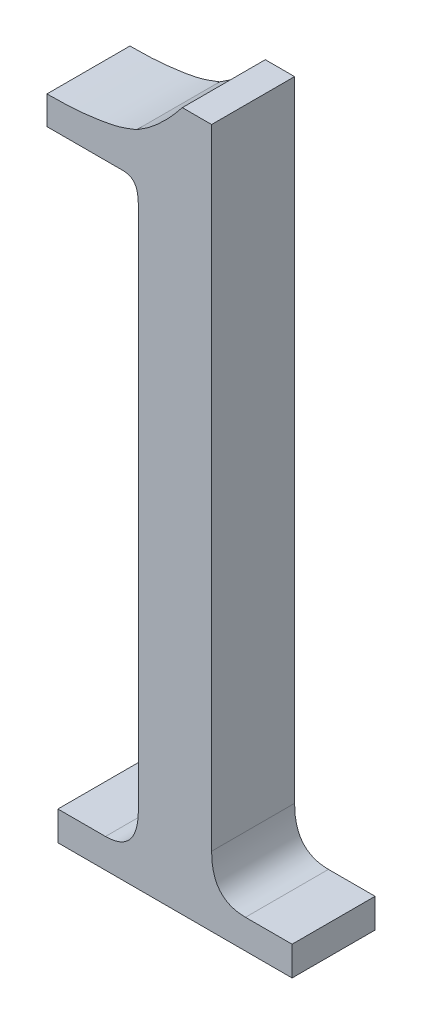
ISO-10303-21;
HEADER;
FILE_DESCRIPTION(('STEP AP214'),'2;1');
FILE_NAME('part.step','',(''),(''),'','','');
FILE_SCHEMA(('AUTOMOTIVE_DESIGN { 1 0 10303 214 1 1 1 1 }'));
ENDSEC;
DATA;
#1=APPLICATION_CONTEXT('core data for automotive mechanical design processes');
#2=APPLICATION_PROTOCOL_DEFINITION('international standard','automotive_design',2000,#1);
#3=PRODUCT_CONTEXT('',#1,'mechanical');
#4=PRODUCT('Part','Part','',(#3));
#5=PRODUCT_RELATED_PRODUCT_CATEGORY('part','',(#4));
#6=PRODUCT_DEFINITION_FORMATION('','',#4);
#7=PRODUCT_DEFINITION_CONTEXT('part definition',#1,'design');
#8=PRODUCT_DEFINITION('design','',#6,#7);
#9=PRODUCT_DEFINITION_SHAPE('','',#8);
#10=(LENGTH_UNIT() NAMED_UNIT(*) SI_UNIT(.MILLI.,.METRE.));
#11=(NAMED_UNIT(*) PLANE_ANGLE_UNIT() SI_UNIT($,.RADIAN.));
#12=(NAMED_UNIT(*) SI_UNIT($,.STERADIAN.) SOLID_ANGLE_UNIT());
#13=UNCERTAINTY_MEASURE_WITH_UNIT(LENGTH_MEASURE(1.E-05),#10,'distance_accuracy_value','');
#14=(GEOMETRIC_REPRESENTATION_CONTEXT(3) GLOBAL_UNCERTAINTY_ASSIGNED_CONTEXT((#13)) GLOBAL_UNIT_ASSIGNED_CONTEXT((#10,
#11,#12)) REPRESENTATION_CONTEXT('',''));
#15=CARTESIAN_POINT('',(0.,0.,0.));
#16=DIRECTION('',(0.,0.,1.));
#17=DIRECTION('',(1.,0.,0.));
#18=AXIS2_PLACEMENT_3D('',#15,#16,#17);
#19=CARTESIAN_POINT('',(6.68234371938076,22.4230844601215,3.));
#20=CARTESIAN_POINT('',(6.82190338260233,22.5095823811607,3.));
#21=CARTESIAN_POINT('',(7.11344816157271,22.6902794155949,3.));
#22=CARTESIAN_POINT('',(7.52295031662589,23.0428818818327,3.));
#23=CARTESIAN_POINT('',(7.94173190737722,23.4567780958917,3.));
#24=CARTESIAN_POINT('',(8.19924344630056,23.7757209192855,3.));
#25=CARTESIAN_POINT('',(8.33333333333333,23.9417989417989,3.));
#26=B_SPLINE_CURVE_WITH_KNOTS('',3,(#19,#20,#21,#22,#23,#24,#25),.UNSPECIFIED.,.F.,.F.,(4,1,1,1,
4),(0.,0.218007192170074,0.455424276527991,0.716431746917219,1.),.UNSPECIFIED.);
#27=DIRECTION('',(0.,0.,-1.));
#28=VECTOR('',#27,1.);
#29=SURFACE_OF_LINEAR_EXTRUSION('',#26,#28);
#30=CARTESIAN_POINT('',(6.68234371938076,22.4230844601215,0.));
#31=CARTESIAN_POINT('',(6.82190338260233,22.5095823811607,0.));
#32=CARTESIAN_POINT('',(7.11344816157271,22.6902794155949,0.));
#33=CARTESIAN_POINT('',(7.52295031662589,23.0428818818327,0.));
#34=CARTESIAN_POINT('',(7.94173190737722,23.4567780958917,0.));
#35=CARTESIAN_POINT('',(8.19924344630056,23.7757209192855,0.));
#36=CARTESIAN_POINT('',(8.33333333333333,23.9417989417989,0.));
#37=B_SPLINE_CURVE_WITH_KNOTS('',3,(#30,#31,#32,#33,#34,#35,#36),.UNSPECIFIED.,.F.,.F.,(4,1,1,1,
4),(0.,0.218007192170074,0.455424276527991,0.716431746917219,1.),.UNSPECIFIED.);
#38=CARTESIAN_POINT('',(6.68234371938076,22.4230844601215,0.));
#39=VERTEX_POINT('',#38);
#40=CARTESIAN_POINT('',(8.33333333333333,23.9417989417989,0.));
#41=VERTEX_POINT('',#40);
#42=EDGE_CURVE('E191',#39,#41,#37,.T.);
#43=ORIENTED_EDGE('',*,*,#42,.F.);
#44=DIRECTION('',(0.,0.,-1.));
#45=VECTOR('',#44,1.);
#46=CARTESIAN_POINT('',(6.68234371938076,22.4230844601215,3.));
#47=LINE('',#46,#45);
#48=CARTESIAN_POINT('',(6.68234371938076,22.4230844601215,3.));
#49=VERTEX_POINT('',#48);
#50=EDGE_CURVE('E11',#49,#39,#47,.T.);
#51=ORIENTED_EDGE('',*,*,#50,.F.);
#52=CARTESIAN_POINT('',(8.33333333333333,23.9417989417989,3.));
#53=VERTEX_POINT('',#52);
#54=EDGE_CURVE('E282',#49,#53,#26,.T.);
#55=ORIENTED_EDGE('',*,*,#54,.T.);
#56=DIRECTION('',(0.,0.,-1.));
#57=VECTOR('',#56,1.);
#58=CARTESIAN_POINT('',(8.33333333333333,23.9417989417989,3.));
#59=LINE('',#58,#57);
#60=EDGE_CURVE('E43',#53,#41,#59,.T.);
#61=ORIENTED_EDGE('',*,*,#60,.T.);
#62=EDGE_LOOP('',(#43,#51,#55,#61));
#63=FACE_BOUND('',#62,.T.);
#64=ADVANCED_FACE('F39',(#63),#29,.T.);
#65=CARTESIAN_POINT('',(3.43915343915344,21.9233784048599,3.));
#66=CARTESIAN_POINT('',(3.77108418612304,21.9269444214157,3.));
#67=CARTESIAN_POINT('',(4.39739537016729,21.9336730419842,3.));
#68=CARTESIAN_POINT('',(5.27085332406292,22.0366371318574,3.));
#69=CARTESIAN_POINT('',(6.03109211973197,22.1721542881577,3.));
#70=CARTESIAN_POINT('',(6.47515955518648,22.3432554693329,3.));
#71=CARTESIAN_POINT('',(6.68234371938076,22.4230844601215,3.));
#72=B_SPLINE_CURVE_WITH_KNOTS('',3,(#65,#66,#67,#68,#69,#70,#71),.UNSPECIFIED.,.F.,.F.,(4,1,1,1,
4),(0.,0.301313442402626,0.568540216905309,0.798698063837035,1.),.UNSPECIFIED.);
#73=DIRECTION('',(0.,0.,-1.));
#74=VECTOR('',#73,1.);
#75=SURFACE_OF_LINEAR_EXTRUSION('',#72,#74);
#76=CARTESIAN_POINT('',(3.43915343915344,21.9233784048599,0.));
#77=CARTESIAN_POINT('',(3.77108418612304,21.9269444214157,0.));
#78=CARTESIAN_POINT('',(4.39739537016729,21.9336730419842,0.));
#79=CARTESIAN_POINT('',(5.27085332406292,22.0366371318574,0.));
#80=CARTESIAN_POINT('',(6.03109211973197,22.1721542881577,0.));
#81=CARTESIAN_POINT('',(6.47515955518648,22.3432554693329,0.));
#82=CARTESIAN_POINT('',(6.68234371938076,22.4230844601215,0.));
#83=B_SPLINE_CURVE_WITH_KNOTS('',3,(#76,#77,#78,#79,#80,#81,#82),.UNSPECIFIED.,.F.,.F.,(4,1,1,1,
4),(0.,0.301313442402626,0.568540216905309,0.798698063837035,1.),.UNSPECIFIED.);
#84=CARTESIAN_POINT('',(3.43915343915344,21.9233784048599,0.));
#85=VERTEX_POINT('',#84);
#86=EDGE_CURVE('E290',#85,#39,#83,.T.);
#87=ORIENTED_EDGE('',*,*,#86,.F.);
#88=DIRECTION('',(0.,0.,-1.));
#89=VECTOR('',#88,1.);
#90=CARTESIAN_POINT('',(3.43915343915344,21.9233784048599,3.));
#91=LINE('',#90,#89);
#92=CARTESIAN_POINT('',(3.43915343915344,21.9233784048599,3.));
#93=VERTEX_POINT('',#92);
#94=EDGE_CURVE('E50',#93,#85,#91,.T.);
#95=ORIENTED_EDGE('',*,*,#94,.F.);
#96=EDGE_CURVE('E171',#93,#49,#72,.T.);
#97=ORIENTED_EDGE('',*,*,#96,.T.);
#98=ORIENTED_EDGE('',*,*,#50,.T.);
#99=EDGE_LOOP('',(#87,#95,#97,#98));
#100=FACE_BOUND('',#99,.T.);
#101=ADVANCED_FACE('F199',(#100),#75,.T.);
#102=CARTESIAN_POINT('',(3.43915343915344,20.8994708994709,3.));
#103=DIRECTION('',(-1.,0.,0.));
#104=DIRECTION('',(0.,0.,1.));
#105=AXIS2_PLACEMENT_3D('',#102,#103,#104);
#106=PLANE('',#105);
#107=DIRECTION('',(0.,1.,0.));
#108=VECTOR('',#107,1.);
#109=CARTESIAN_POINT('',(3.43915343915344,20.8994708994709,0.));
#110=LINE('',#109,#108);
#111=CARTESIAN_POINT('',(3.43915343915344,20.8994708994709,0.));
#112=VERTEX_POINT('',#111);
#113=EDGE_CURVE('E157',#112,#85,#110,.T.);
#114=ORIENTED_EDGE('',*,*,#113,.F.);
#115=DIRECTION('',(0.,0.,-1.));
#116=VECTOR('',#115,1.);
#117=CARTESIAN_POINT('',(3.43915343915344,20.8994708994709,3.));
#118=LINE('',#117,#116);
#119=CARTESIAN_POINT('',(3.43915343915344,20.8994708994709,3.));
#120=VERTEX_POINT('',#119);
#121=EDGE_CURVE('E152',#120,#112,#118,.T.);
#122=ORIENTED_EDGE('',*,*,#121,.F.);
#123=DIRECTION('',(0.,1.,0.));
#124=VECTOR('',#123,1.);
#125=CARTESIAN_POINT('',(3.43915343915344,20.8994708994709,3.));
#126=LINE('',#125,#124);
#127=EDGE_CURVE('E155',#120,#93,#126,.T.);
#128=ORIENTED_EDGE('',*,*,#127,.T.);
#129=ORIENTED_EDGE('',*,*,#94,.T.);
#130=EDGE_LOOP('',(#114,#122,#128,#129));
#131=FACE_BOUND('',#130,.T.);
#132=ADVANCED_FACE('F154',(#131),#106,.T.);
#133=CARTESIAN_POINT('',(6.21693121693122,20.8994708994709,3.));
#134=DIRECTION('',(0.,-1.,0.));
#135=DIRECTION('',(0.,0.,-1.));
#136=AXIS2_PLACEMENT_3D('',#133,#134,#135);
#137=PLANE('',#136);
#138=DIRECTION('',(-1.,0.,0.));
#139=VECTOR('',#138,1.);
#140=CARTESIAN_POINT('',(6.21693121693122,20.8994708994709,0.));
#141=LINE('',#140,#139);
#142=CARTESIAN_POINT('',(6.21693121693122,20.8994708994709,0.));
#143=VERTEX_POINT('',#142);
#144=EDGE_CURVE('E327',#143,#112,#141,.T.);
#145=ORIENTED_EDGE('',*,*,#144,.F.);
#146=DIRECTION('',(0.,0.,-1.));
#147=VECTOR('',#146,1.);
#148=CARTESIAN_POINT('',(6.21693121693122,20.8994708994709,3.));
#149=LINE('',#148,#147);
#150=CARTESIAN_POINT('',(6.21693121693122,20.8994708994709,3.));
#151=VERTEX_POINT('',#150);
#152=EDGE_CURVE('E163',#151,#143,#149,.T.);
#153=ORIENTED_EDGE('',*,*,#152,.F.);
#154=DIRECTION('',(-1.,0.,0.));
#155=VECTOR('',#154,1.);
#156=CARTESIAN_POINT('',(6.21693121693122,20.8994708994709,3.));
#157=LINE('',#156,#155);
#158=EDGE_CURVE('E169',#151,#120,#157,.T.);
#159=ORIENTED_EDGE('',*,*,#158,.T.);
#160=ORIENTED_EDGE('',*,*,#121,.T.);
#161=EDGE_LOOP('',(#145,#153,#159,#160));
#162=FACE_BOUND('',#161,.T.);
#163=ADVANCED_FACE('F174',(#162),#137,.T.);
#164=CARTESIAN_POINT('',(6.74603174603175,20.1058201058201,3.));
#165=CARTESIAN_POINT('',(6.74063564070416,20.2224013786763,3.));
#166=CARTESIAN_POINT('',(6.73109615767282,20.428499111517,3.));
#167=CARTESIAN_POINT('',(6.64120087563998,20.7005786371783,3.));
#168=CARTESIAN_POINT('',(6.45230240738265,20.8761415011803,3.));
#169=CARTESIAN_POINT('',(6.29689084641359,20.8915455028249,3.));
#170=CARTESIAN_POINT('',(6.21693121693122,20.8994708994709,3.));
#171=B_SPLINE_CURVE_WITH_KNOTS('',3,(#164,#165,#166,#167,#168,#169,#170),.UNSPECIFIED.,.F.,.F.,
(4,1,1,1,4),(0.,0.324999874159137,0.574549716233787,0.781104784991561,1.),.UNSPECIFIED.);
#172=DIRECTION('',(0.,0.,-1.));
#173=VECTOR('',#172,1.);
#174=SURFACE_OF_LINEAR_EXTRUSION('',#171,#173);
#175=CARTESIAN_POINT('',(6.74603174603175,20.1058201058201,0.));
#176=CARTESIAN_POINT('',(6.74063564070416,20.2224013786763,0.));
#177=CARTESIAN_POINT('',(6.73109615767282,20.428499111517,0.));
#178=CARTESIAN_POINT('',(6.64120087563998,20.7005786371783,0.));
#179=CARTESIAN_POINT('',(6.45230240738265,20.8761415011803,0.));
#180=CARTESIAN_POINT('',(6.29689084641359,20.8915455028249,0.));
#181=CARTESIAN_POINT('',(6.21693121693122,20.8994708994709,0.));
#182=B_SPLINE_CURVE_WITH_KNOTS('',3,(#175,#176,#177,#178,#179,#180,#181),.UNSPECIFIED.,.F.,.F.,
(4,1,1,1,4),(0.,0.324999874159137,0.574549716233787,0.781104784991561,1.),.UNSPECIFIED.);
#183=CARTESIAN_POINT('',(6.74603174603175,20.1058201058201,0.));
#184=VERTEX_POINT('',#183);
#185=EDGE_CURVE('E323',#184,#143,#182,.T.);
#186=ORIENTED_EDGE('',*,*,#185,.F.);
#187=DIRECTION('',(0.,0.,-1.));
#188=VECTOR('',#187,1.);
#189=CARTESIAN_POINT('',(6.74603174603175,20.1058201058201,3.));
#190=LINE('',#189,#188);
#191=CARTESIAN_POINT('',(6.74603174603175,20.1058201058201,3.));
#192=VERTEX_POINT('',#191);
#193=EDGE_CURVE('E240',#192,#184,#190,.T.);
#194=ORIENTED_EDGE('',*,*,#193,.F.);
#195=EDGE_CURVE('E176',#192,#151,#171,.T.);
#196=ORIENTED_EDGE('',*,*,#195,.T.);
#197=ORIENTED_EDGE('',*,*,#152,.T.);
#198=EDGE_LOOP('',(#186,#194,#196,#197));
#199=FACE_BOUND('',#198,.T.);
#200=ADVANCED_FACE('F209',(#199),#174,.T.);
#201=CARTESIAN_POINT('',(6.74603174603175,1.19047619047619,3.));
#202=DIRECTION('',(-1.,0.,0.));
#203=DIRECTION('',(0.,0.,1.));
#204=AXIS2_PLACEMENT_3D('',#201,#202,#203);
#205=PLANE('',#204);
#206=DIRECTION('',(0.,1.,0.));
#207=VECTOR('',#206,1.);
#208=CARTESIAN_POINT('',(6.74603174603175,1.19047619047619,0.));
#209=LINE('',#208,#207);
#210=CARTESIAN_POINT('',(6.74603174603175,1.19047619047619,0.));
#211=VERTEX_POINT('',#210);
#212=EDGE_CURVE('E319',#211,#184,#209,.T.);
#213=ORIENTED_EDGE('',*,*,#212,.F.);
#214=DIRECTION('',(0.,0.,-1.));
#215=VECTOR('',#214,1.);
#216=CARTESIAN_POINT('',(6.74603174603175,1.19047619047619,3.));
#217=LINE('',#216,#215);
#218=CARTESIAN_POINT('',(6.74603174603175,1.19047619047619,3.));
#219=VERTEX_POINT('',#218);
#220=EDGE_CURVE('E242',#219,#211,#217,.T.);
#221=ORIENTED_EDGE('',*,*,#220,.F.);
#222=DIRECTION('',(0.,1.,0.));
#223=VECTOR('',#222,1.);
#224=CARTESIAN_POINT('',(6.74603174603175,1.19047619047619,3.));
#225=LINE('',#224,#223);
#226=EDGE_CURVE('E179',#219,#192,#225,.T.);
#227=ORIENTED_EDGE('',*,*,#226,.T.);
#228=ORIENTED_EDGE('',*,*,#193,.T.);
#229=EDGE_LOOP('',(#213,#221,#227,#228));
#230=FACE_BOUND('',#229,.T.);
#231=ADVANCED_FACE('F212',(#230),#205,.T.);
#232=CARTESIAN_POINT('',(5.55555555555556,-0.264550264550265,3.));
#233=CARTESIAN_POINT('',(5.64915669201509,-0.260173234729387,3.));
#234=CARTESIAN_POINT('',(5.82612167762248,-0.251897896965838,3.));
#235=CARTESIAN_POINT('',(6.0733961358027,-0.181357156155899,3.));
#236=CARTESIAN_POINT('',(6.28509363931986,-0.0684946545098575,3.));
#237=CARTESIAN_POINT('',(6.45826477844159,0.095893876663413,3.));
#238=CARTESIAN_POINT('',(6.59110675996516,0.306367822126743,3.));
#239=CARTESIAN_POINT('',(6.68330014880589,0.561959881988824,3.));
#240=CARTESIAN_POINT('',(6.73549812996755,0.861767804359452,3.));
#241=CARTESIAN_POINT('',(6.74236150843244,1.07594402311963,3.));
#242=CARTESIAN_POINT('',(6.74603174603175,1.19047619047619,3.));
#243=B_SPLINE_CURVE_WITH_KNOTS('',3,(#232,#233,#234,#235,#236,#237,#238,#239,#240,#241,#242),
.UNSPECIFIED.,.F.,.F.,(4,1,1,1,1,1,1,1,4),(0.,0.130569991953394,0.246859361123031,
0.356130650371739,0.462675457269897,0.576612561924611,0.700805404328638,0.840003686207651,1.),.UNSPECIFIED.);
#244=DIRECTION('',(0.,0.,-1.));
#245=VECTOR('',#244,1.);
#246=SURFACE_OF_LINEAR_EXTRUSION('',#243,#245);
#247=CARTESIAN_POINT('',(5.55555555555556,-0.264550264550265,0.));
#248=CARTESIAN_POINT('',(5.64915669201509,-0.260173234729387,0.));
#249=CARTESIAN_POINT('',(5.82612167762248,-0.251897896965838,0.));
#250=CARTESIAN_POINT('',(6.0733961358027,-0.181357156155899,0.));
#251=CARTESIAN_POINT('',(6.28509363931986,-0.0684946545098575,0.));
#252=CARTESIAN_POINT('',(6.45826477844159,0.095893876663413,0.));
#253=CARTESIAN_POINT('',(6.59110675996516,0.306367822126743,0.));
#254=CARTESIAN_POINT('',(6.68330014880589,0.561959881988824,0.));
#255=CARTESIAN_POINT('',(6.73549812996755,0.861767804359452,0.));
#256=CARTESIAN_POINT('',(6.74236150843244,1.07594402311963,0.));
#257=CARTESIAN_POINT('',(6.74603174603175,1.19047619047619,0.));
#258=B_SPLINE_CURVE_WITH_KNOTS('',3,(#247,#248,#249,#250,#251,#252,#253,#254,#255,#256,#257),
.UNSPECIFIED.,.F.,.F.,(4,1,1,1,1,1,1,1,4),(0.,0.130569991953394,0.246859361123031,
0.356130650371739,0.462675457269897,0.576612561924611,0.700805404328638,0.840003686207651,1.),.UNSPECIFIED.);
#259=CARTESIAN_POINT('',(5.55555555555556,-0.264550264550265,0.));
#260=VERTEX_POINT('',#259);
#261=EDGE_CURVE('E249',#260,#211,#258,.T.);
#262=ORIENTED_EDGE('',*,*,#261,.F.);
#263=DIRECTION('',(0.,0.,-1.));
#264=VECTOR('',#263,1.);
#265=CARTESIAN_POINT('',(5.55555555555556,-0.264550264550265,3.));
#266=LINE('',#265,#264);
#267=CARTESIAN_POINT('',(5.55555555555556,-0.264550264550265,3.));
#268=VERTEX_POINT('',#267);
#269=EDGE_CURVE('E247',#268,#260,#266,.T.);
#270=ORIENTED_EDGE('',*,*,#269,.F.);
#271=EDGE_CURVE('E224',#268,#219,#243,.T.);
#272=ORIENTED_EDGE('',*,*,#271,.T.);
#273=ORIENTED_EDGE('',*,*,#220,.T.);
#274=EDGE_LOOP('',(#262,#270,#272,#273));
#275=FACE_BOUND('',#274,.T.);
#276=ADVANCED_FACE('F216',(#275),#246,.T.);
#277=CARTESIAN_POINT('',(3.83597883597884,-0.264550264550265,3.));
#278=DIRECTION('',(0.,1.,0.));
#279=DIRECTION('',(0.,0.,1.));
#280=AXIS2_PLACEMENT_3D('',#277,#278,#279);
#281=PLANE('',#280);
#282=DIRECTION('',(1.,0.,0.));
#283=VECTOR('',#282,1.);
#284=CARTESIAN_POINT('',(3.83597883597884,-0.264550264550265,0.));
#285=LINE('',#284,#283);
#286=CARTESIAN_POINT('',(3.83597883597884,-0.264550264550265,0.));
#287=VERTEX_POINT('',#286);
#288=EDGE_CURVE('E314',#287,#260,#285,.T.);
#289=ORIENTED_EDGE('',*,*,#288,.F.);
#290=DIRECTION('',(0.,0.,-1.));
#291=VECTOR('',#290,1.);
#292=CARTESIAN_POINT('',(3.83597883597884,-0.264550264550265,3.));
#293=LINE('',#292,#291);
#294=CARTESIAN_POINT('',(3.83597883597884,-0.264550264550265,3.));
#295=VERTEX_POINT('',#294);
#296=EDGE_CURVE('E254',#295,#287,#293,.T.);
#297=ORIENTED_EDGE('',*,*,#296,.F.);
#298=DIRECTION('',(1.,0.,0.));
#299=VECTOR('',#298,1.);
#300=CARTESIAN_POINT('',(3.83597883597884,-0.264550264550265,3.));
#301=LINE('',#300,#299);
#302=EDGE_CURVE('E231',#295,#268,#301,.T.);
#303=ORIENTED_EDGE('',*,*,#302,.T.);
#304=ORIENTED_EDGE('',*,*,#269,.T.);
#305=EDGE_LOOP('',(#289,#297,#303,#304));
#306=FACE_BOUND('',#305,.T.);
#307=ADVANCED_FACE('F221',(#306),#281,.T.);
#308=CARTESIAN_POINT('',(3.83597883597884,-1.32275132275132,3.));
#309=DIRECTION('',(-1.,0.,0.));
#310=DIRECTION('',(0.,0.,1.));
#311=AXIS2_PLACEMENT_3D('',#308,#309,#310);
#312=PLANE('',#311);
#313=DIRECTION('',(0.,1.,0.));
#314=VECTOR('',#313,1.);
#315=CARTESIAN_POINT('',(3.83597883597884,-1.32275132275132,0.));
#316=LINE('',#315,#314);
#317=CARTESIAN_POINT('',(3.83597883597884,-1.32275132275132,0.));
#318=VERTEX_POINT('',#317);
#319=EDGE_CURVE('E310',#318,#287,#316,.T.);
#320=ORIENTED_EDGE('',*,*,#319,.F.);
#321=DIRECTION('',(0.,0.,-1.));
#322=VECTOR('',#321,1.);
#323=CARTESIAN_POINT('',(3.83597883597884,-1.32275132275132,3.));
#324=LINE('',#323,#322);
#325=CARTESIAN_POINT('',(3.83597883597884,-1.32275132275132,3.));
#326=VERTEX_POINT('',#325);
#327=EDGE_CURVE('E259',#326,#318,#324,.T.);
#328=ORIENTED_EDGE('',*,*,#327,.F.);
#329=DIRECTION('',(0.,1.,0.));
#330=VECTOR('',#329,1.);
#331=CARTESIAN_POINT('',(3.83597883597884,-1.32275132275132,3.));
#332=LINE('',#331,#330);
#333=EDGE_CURVE('E358',#326,#295,#332,.T.);
#334=ORIENTED_EDGE('',*,*,#333,.T.);
#335=ORIENTED_EDGE('',*,*,#296,.T.);
#336=EDGE_LOOP('',(#320,#328,#334,#335));
#337=FACE_BOUND('',#336,.T.);
#338=ADVANCED_FACE('F366',(#337),#312,.T.);
#339=CARTESIAN_POINT('',(12.3015873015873,-1.32275132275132,3.));
#340=DIRECTION('',(0.,-1.,0.));
#341=DIRECTION('',(0.,0.,-1.));
#342=AXIS2_PLACEMENT_3D('',#339,#340,#341);
#343=PLANE('',#342);
#344=DIRECTION('',(-1.,0.,0.));
#345=VECTOR('',#344,1.);
#346=CARTESIAN_POINT('',(12.3015873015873,-1.32275132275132,0.));
#347=LINE('',#346,#345);
#348=CARTESIAN_POINT('',(12.3015873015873,-1.32275132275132,0.));
#349=VERTEX_POINT('',#348);
#350=EDGE_CURVE('E306',#349,#318,#347,.T.);
#351=ORIENTED_EDGE('',*,*,#350,.F.);
#352=DIRECTION('',(0.,0.,-1.));
#353=VECTOR('',#352,1.);
#354=CARTESIAN_POINT('',(12.3015873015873,-1.32275132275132,3.));
#355=LINE('',#354,#353);
#356=CARTESIAN_POINT('',(12.3015873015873,-1.32275132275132,3.));
#357=VERTEX_POINT('',#356);
#358=EDGE_CURVE('E265',#357,#349,#355,.T.);
#359=ORIENTED_EDGE('',*,*,#358,.F.);
#360=DIRECTION('',(-1.,0.,0.));
#361=VECTOR('',#360,1.);
#362=CARTESIAN_POINT('',(12.3015873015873,-1.32275132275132,3.));
#363=LINE('',#362,#361);
#364=EDGE_CURVE('E354',#357,#326,#363,.T.);
#365=ORIENTED_EDGE('',*,*,#364,.T.);
#366=ORIENTED_EDGE('',*,*,#327,.T.);
#367=EDGE_LOOP('',(#351,#359,#365,#366));
#368=FACE_BOUND('',#367,.T.);
#369=ADVANCED_FACE('F369',(#368),#343,.T.);
#370=CARTESIAN_POINT('',(12.3015873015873,-0.264550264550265,3.));
#371=DIRECTION('',(1.,0.,0.));
#372=DIRECTION('',(0.,0.,-1.));
#373=AXIS2_PLACEMENT_3D('',#370,#371,#372);
#374=PLANE('',#373);
#375=DIRECTION('',(0.,-1.,0.));
#376=VECTOR('',#375,1.);
#377=CARTESIAN_POINT('',(12.3015873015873,-0.264550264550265,0.));
#378=LINE('',#377,#376);
#379=CARTESIAN_POINT('',(12.3015873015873,-0.264550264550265,0.));
#380=VERTEX_POINT('',#379);
#381=EDGE_CURVE('E302',#380,#349,#378,.T.);
#382=ORIENTED_EDGE('',*,*,#381,.F.);
#383=DIRECTION('',(0.,0.,-1.));
#384=VECTOR('',#383,1.);
#385=CARTESIAN_POINT('',(12.3015873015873,-0.264550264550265,3.));
#386=LINE('',#385,#384);
#387=CARTESIAN_POINT('',(12.3015873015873,-0.264550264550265,3.));
#388=VERTEX_POINT('',#387);
#389=EDGE_CURVE('E268',#388,#380,#386,.T.);
#390=ORIENTED_EDGE('',*,*,#389,.F.);
#391=DIRECTION('',(0.,-1.,0.));
#392=VECTOR('',#391,1.);
#393=CARTESIAN_POINT('',(12.3015873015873,-0.264550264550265,3.));
#394=LINE('',#393,#392);
#395=EDGE_CURVE('E350',#388,#357,#394,.T.);
#396=ORIENTED_EDGE('',*,*,#395,.T.);
#397=ORIENTED_EDGE('',*,*,#358,.T.);
#398=EDGE_LOOP('',(#382,#390,#396,#397));
#399=FACE_BOUND('',#398,.T.);
#400=ADVANCED_FACE('F374',(#399),#374,.T.);
#401=CARTESIAN_POINT('',(10.6163041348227,-0.264550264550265,3.));
#402=DIRECTION('',(0.,1.,0.));
#403=DIRECTION('',(0.,0.,1.));
#404=AXIS2_PLACEMENT_3D('',#401,#402,#403);
#405=PLANE('',#404);
#406=DIRECTION('',(1.,0.,0.));
#407=VECTOR('',#406,1.);
#408=CARTESIAN_POINT('',(10.6163041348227,-0.264550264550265,0.));
#409=LINE('',#408,#407);
#410=CARTESIAN_POINT('',(10.6163041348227,-0.264550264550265,0.));
#411=VERTEX_POINT('',#410);
#412=EDGE_CURVE('E298',#411,#380,#409,.T.);
#413=ORIENTED_EDGE('',*,*,#412,.F.);
#414=DIRECTION('',(0.,0.,-1.));
#415=VECTOR('',#414,1.);
#416=CARTESIAN_POINT('',(10.6163041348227,-0.264550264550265,3.));
#417=LINE('',#416,#415);
#418=CARTESIAN_POINT('',(10.6163041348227,-0.264550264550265,3.));
#419=VERTEX_POINT('',#418);
#420=EDGE_CURVE('E271',#419,#411,#417,.T.);
#421=ORIENTED_EDGE('',*,*,#420,.F.);
#422=DIRECTION('',(1.,0.,0.));
#423=VECTOR('',#422,1.);
#424=CARTESIAN_POINT('',(10.6163041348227,-0.264550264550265,3.));
#425=LINE('',#424,#423);
#426=EDGE_CURVE('E346',#419,#388,#425,.T.);
#427=ORIENTED_EDGE('',*,*,#426,.T.);
#428=ORIENTED_EDGE('',*,*,#389,.T.);
#429=EDGE_LOOP('',(#413,#421,#427,#428));
#430=FACE_BOUND('',#429,.T.);
#431=ADVANCED_FACE('F377',(#430),#405,.T.);
#432=CARTESIAN_POINT('',(9.39153439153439,1.19047619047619,3.));
#433=CARTESIAN_POINT('',(9.39451002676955,1.07579594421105,3.));
#434=CARTESIAN_POINT('',(9.4000824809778,0.861034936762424,3.));
#435=CARTESIAN_POINT('',(9.4608914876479,0.5627389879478,3.));
#436=CARTESIAN_POINT('',(9.5502164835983,0.304805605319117,3.));
#437=CARTESIAN_POINT('',(9.68966395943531,0.0955789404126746,3.));
#438=CARTESIAN_POINT('',(9.86741546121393,-0.0686945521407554,3.));
#439=CARTESIAN_POINT('',(10.0840017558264,-0.181353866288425,3.));
#440=CARTESIAN_POINT('',(10.33760313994,-0.252311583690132,3.));
#441=CARTESIAN_POINT('',(10.5194289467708,-0.260296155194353,3.));
#442=CARTESIAN_POINT('',(10.6163041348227,-0.264550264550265,3.));
#443=B_SPLINE_CURVE_WITH_KNOTS('',3,(#432,#433,#434,#435,#436,#437,#438,#439,#440,#441,#442),
.UNSPECIFIED.,.F.,.F.,(4,1,1,1,1,1,1,1,4),(0.,0.158083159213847,0.29604138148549,
0.418749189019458,0.532558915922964,0.639482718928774,0.749430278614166,0.866498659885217,1.),.UNSPECIFIED.);
#444=DIRECTION('',(0.,0.,-1.));
#445=VECTOR('',#444,1.);
#446=SURFACE_OF_LINEAR_EXTRUSION('',#443,#445);
#447=CARTESIAN_POINT('',(9.39153439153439,1.19047619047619,0.));
#448=CARTESIAN_POINT('',(9.39451002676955,1.07579594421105,0.));
#449=CARTESIAN_POINT('',(9.4000824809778,0.861034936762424,0.));
#450=CARTESIAN_POINT('',(9.4608914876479,0.5627389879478,0.));
#451=CARTESIAN_POINT('',(9.5502164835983,0.304805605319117,0.));
#452=CARTESIAN_POINT('',(9.68966395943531,0.0955789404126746,0.));
#453=CARTESIAN_POINT('',(9.86741546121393,-0.0686945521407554,0.));
#454=CARTESIAN_POINT('',(10.0840017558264,-0.181353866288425,0.));
#455=CARTESIAN_POINT('',(10.33760313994,-0.252311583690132,0.));
#456=CARTESIAN_POINT('',(10.5194289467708,-0.260296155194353,0.));
#457=CARTESIAN_POINT('',(10.6163041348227,-0.264550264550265,0.));
#458=B_SPLINE_CURVE_WITH_KNOTS('',3,(#447,#448,#449,#450,#451,#452,#453,#454,#455,#456,#457),
.UNSPECIFIED.,.F.,.F.,(4,1,1,1,1,1,1,1,4),(0.,0.158083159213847,0.29604138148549,
0.418749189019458,0.532558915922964,0.639482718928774,0.749430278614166,0.866498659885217,1.),.UNSPECIFIED.);
#459=CARTESIAN_POINT('',(9.39153439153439,1.19047619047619,0.));
#460=VERTEX_POINT('',#459);
#461=EDGE_CURVE('E294',#460,#411,#458,.T.);
#462=ORIENTED_EDGE('',*,*,#461,.F.);
#463=DIRECTION('',(0.,0.,-1.));
#464=VECTOR('',#463,1.);
#465=CARTESIAN_POINT('',(9.39153439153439,1.19047619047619,3.));
#466=LINE('',#465,#464);
#467=CARTESIAN_POINT('',(9.39153439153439,1.19047619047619,3.));
#468=VERTEX_POINT('',#467);
#469=EDGE_CURVE('E274',#468,#460,#466,.T.);
#470=ORIENTED_EDGE('',*,*,#469,.F.);
#471=EDGE_CURVE('E342',#468,#419,#443,.T.);
#472=ORIENTED_EDGE('',*,*,#471,.T.);
#473=ORIENTED_EDGE('',*,*,#420,.T.);
#474=EDGE_LOOP('',(#462,#470,#472,#473));
#475=FACE_BOUND('',#474,.T.);
#476=ADVANCED_FACE('F382',(#475),#446,.T.);
#477=CARTESIAN_POINT('',(9.39153439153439,23.9417989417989,3.));
#478=DIRECTION('',(1.,0.,0.));
#479=DIRECTION('',(0.,0.,-1.));
#480=AXIS2_PLACEMENT_3D('',#477,#478,#479);
#481=PLANE('',#480);
#482=DIRECTION('',(0.,-1.,0.));
#483=VECTOR('',#482,1.);
#484=CARTESIAN_POINT('',(9.39153439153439,23.9417989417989,0.));
#485=LINE('',#484,#483);
#486=CARTESIAN_POINT('',(9.39153439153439,23.9417989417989,0.));
#487=VERTEX_POINT('',#486);
#488=EDGE_CURVE('E289',#487,#460,#485,.T.);
#489=ORIENTED_EDGE('',*,*,#488,.F.);
#490=DIRECTION('',(0.,0.,-1.));
#491=VECTOR('',#490,1.);
#492=CARTESIAN_POINT('',(9.39153439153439,23.9417989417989,3.));
#493=LINE('',#492,#491);
#494=CARTESIAN_POINT('',(9.39153439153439,23.9417989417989,3.));
#495=VERTEX_POINT('',#494);
#496=EDGE_CURVE('E276',#495,#487,#493,.T.);
#497=ORIENTED_EDGE('',*,*,#496,.F.);
#498=DIRECTION('',(0.,-1.,0.));
#499=VECTOR('',#498,1.);
#500=CARTESIAN_POINT('',(9.39153439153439,23.9417989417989,3.));
#501=LINE('',#500,#499);
#502=EDGE_CURVE('E338',#495,#468,#501,.T.);
#503=ORIENTED_EDGE('',*,*,#502,.T.);
#504=ORIENTED_EDGE('',*,*,#469,.T.);
#505=EDGE_LOOP('',(#489,#497,#503,#504));
#506=FACE_BOUND('',#505,.T.);
#507=ADVANCED_FACE('F384',(#506),#481,.T.);
#508=CARTESIAN_POINT('',(8.33333333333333,23.9417989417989,3.));
#509=DIRECTION('',(0.,1.,0.));
#510=DIRECTION('',(0.,0.,1.));
#511=AXIS2_PLACEMENT_3D('',#508,#509,#510);
#512=PLANE('',#511);
#513=DIRECTION('',(1.,0.,0.));
#514=VECTOR('',#513,1.);
#515=CARTESIAN_POINT('',(8.33333333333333,23.9417989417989,0.));
#516=LINE('',#515,#514);
#517=EDGE_CURVE('E284',#41,#487,#516,.T.);
#518=ORIENTED_EDGE('',*,*,#517,.F.);
#519=ORIENTED_EDGE('',*,*,#60,.F.);
#520=DIRECTION('',(1.,0.,0.));
#521=VECTOR('',#520,1.);
#522=CARTESIAN_POINT('',(8.33333333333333,23.9417989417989,3.));
#523=LINE('',#522,#521);
#524=EDGE_CURVE('E336',#53,#495,#523,.T.);
#525=ORIENTED_EDGE('',*,*,#524,.T.);
#526=ORIENTED_EDGE('',*,*,#496,.T.);
#527=EDGE_LOOP('',(#518,#519,#525,#526));
#528=FACE_BOUND('',#527,.T.);
#529=ADVANCED_FACE('F285',(#528),#512,.T.);
#530=CARTESIAN_POINT('',(7.57908319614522,23.1041033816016,3.));
#531=DIRECTION('',(0.,0.,-1.));
#532=DIRECTION('',(-1.,0.,0.));
#533=AXIS2_PLACEMENT_3D('',#530,#531,#532);
#534=PLANE('',#533);
#535=ORIENTED_EDGE('',*,*,#54,.F.);
#536=ORIENTED_EDGE('',*,*,#96,.F.);
#537=ORIENTED_EDGE('',*,*,#127,.F.);
#538=ORIENTED_EDGE('',*,*,#158,.F.);
#539=ORIENTED_EDGE('',*,*,#195,.F.);
#540=ORIENTED_EDGE('',*,*,#226,.F.);
#541=ORIENTED_EDGE('',*,*,#271,.F.);
#542=ORIENTED_EDGE('',*,*,#302,.F.);
#543=ORIENTED_EDGE('',*,*,#333,.F.);
#544=ORIENTED_EDGE('',*,*,#364,.F.);
#545=ORIENTED_EDGE('',*,*,#395,.F.);
#546=ORIENTED_EDGE('',*,*,#426,.F.);
#547=ORIENTED_EDGE('',*,*,#471,.F.);
#548=ORIENTED_EDGE('',*,*,#502,.F.);
#549=ORIENTED_EDGE('',*,*,#524,.F.);
#550=EDGE_LOOP('',(#535,#536,#537,#538,#539,#540,#541,#542,#543,#544,#545,#546,#547,#548,#549));
#551=FACE_BOUND('',#550,.T.);
#552=ADVANCED_FACE('F167',(#551),#534,.F.);
#553=CARTESIAN_POINT('',(7.57908319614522,23.1041033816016,0.));
#554=DIRECTION('',(0.,0.,-1.));
#555=DIRECTION('',(-1.,0.,0.));
#556=AXIS2_PLACEMENT_3D('',#553,#554,#555);
#557=PLANE('',#556);
#558=ORIENTED_EDGE('',*,*,#42,.T.);
#559=ORIENTED_EDGE('',*,*,#517,.T.);
#560=ORIENTED_EDGE('',*,*,#488,.T.);
#561=ORIENTED_EDGE('',*,*,#461,.T.);
#562=ORIENTED_EDGE('',*,*,#412,.T.);
#563=ORIENTED_EDGE('',*,*,#381,.T.);
#564=ORIENTED_EDGE('',*,*,#350,.T.);
#565=ORIENTED_EDGE('',*,*,#319,.T.);
#566=ORIENTED_EDGE('',*,*,#288,.T.);
#567=ORIENTED_EDGE('',*,*,#261,.T.);
#568=ORIENTED_EDGE('',*,*,#212,.T.);
#569=ORIENTED_EDGE('',*,*,#185,.T.);
#570=ORIENTED_EDGE('',*,*,#144,.T.);
#571=ORIENTED_EDGE('',*,*,#113,.T.);
#572=ORIENTED_EDGE('',*,*,#86,.T.);
#573=EDGE_LOOP('',(#558,#559,#560,#561,#562,#563,#564,#565,#566,#567,#568,#569,#570,#571,#572));
#574=FACE_BOUND('',#573,.T.);
#575=ADVANCED_FACE('F203',(#574),#557,.T.);
#576=CLOSED_SHELL('',(#64,#101,#132,#163,#200,#231,#276,#307,#338,#369,#400,#431,#476,#507,#529,
#552,#575));
#577=MANIFOLD_SOLID_BREP('B2',#576);
#578=ADVANCED_BREP_SHAPE_REPRESENTATION('',(#18,#577),#14);
#579=SHAPE_DEFINITION_REPRESENTATION(#9,#578);
ENDSEC;
END-ISO-10303-21;
